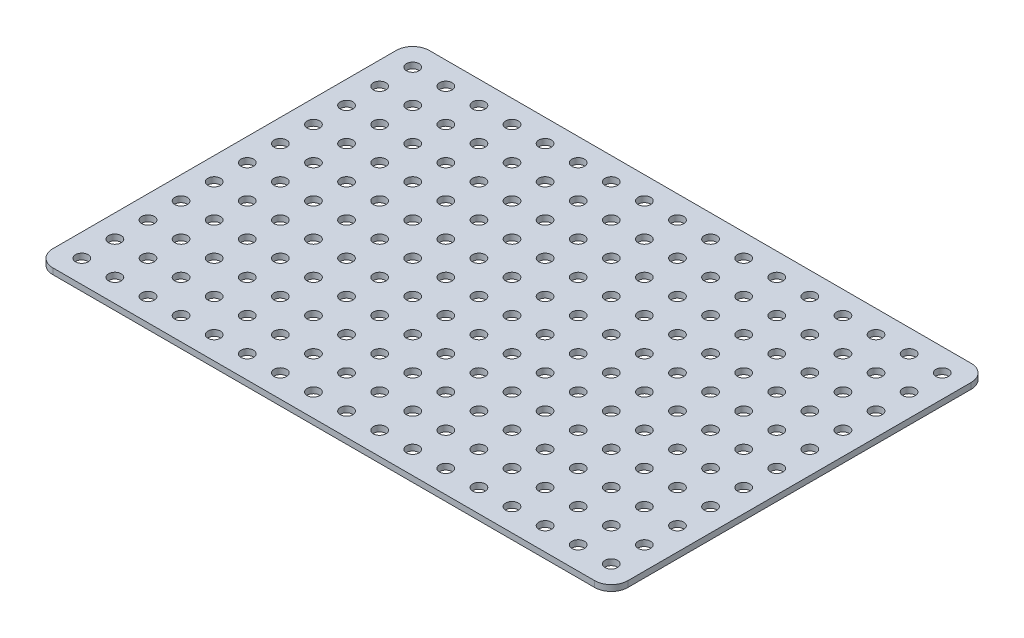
from build123d import *

# Parameters (mm, degrees)
EXTRUDE1_DEPTH       = 2.286
SKETCH2_R            = 2.413
CUT_EXTRUDE1_DEPTH   = 233.209044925
LPATTERN1_COUNT      = 17
LPATTERN1_PITCH      = 12.7
LPATTERN1_COUNT_DIR2 = 11
LPATTERN1_PITCH_DIR2 = 12.7


with BuildPart() as part:
    # Sketch1 → Extrude1 (new body)
    with BuildSketch(Plane(origin=(0, 0, 0), x_dir=(1, 0, 0), z_dir=(0, 1, 0))):
        with BuildLine():
            Line((6.35, -72.2376), (214.3252, -72.2376))
            ThreePointArc((214.3252, -72.2376), (218.815328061, -70.377728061), (220.6752, -65.8876))
            Line((220.6752, -65.8876), (220.6752, 65.8876))
            ThreePointArc((220.6752, 65.8876), (218.815328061, 70.377728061), (214.3252, 72.2376))
            Line((214.3252, 72.2376), (6.35, 72.2376))
            ThreePointArc((6.35, 72.2376), (1.859871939, 70.377728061), (0, 65.8876))
            Line((0, 65.8876), (0, -65.8876))
            ThreePointArc((0, -65.8876), (1.859871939, -70.377728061), (6.35, -72.2376))
        make_face()
    extrude(amount=EXTRUDE1_DEPTH)

    # Sketch2 → Cut-Extrude1 (cut, through all)
    with BuildSketch(Plane(origin=(0, 2.286, 0), x_dir=(-1, 0, 0), z_dir=(0, 1, 0))):
        with Locations(Location((-8.7376, 63.5, 0), (0, 0, 90))):
            Circle(SKETCH2_R)
    cut_extrude1 = extrude(amount=-CUT_EXTRUDE1_DEPTH, mode=Mode.SUBTRACT)

    # LPattern1: Cut-Extrude1 17 × 11
    with Locations(*[(i * LPATTERN1_PITCH, 0, -j * LPATTERN1_PITCH_DIR2) for i in range(LPATTERN1_COUNT) for j in range(LPATTERN1_COUNT_DIR2) if (i, j) != (0, 0)]):
        add(cut_extrude1, mode=Mode.SUBTRACT)


solid = part.part
